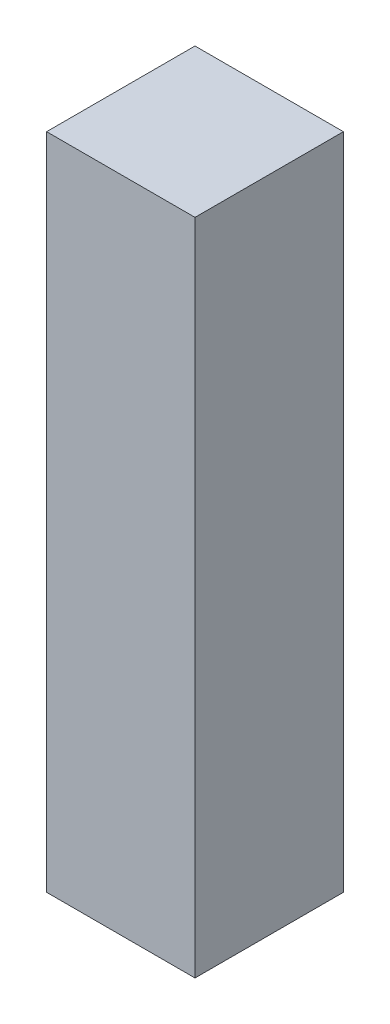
ISO-10303-21;
HEADER;
FILE_DESCRIPTION(('STEP AP214'),'2;1');
FILE_NAME('part.step','',(''),(''),'','','');
FILE_SCHEMA(('AUTOMOTIVE_DESIGN { 1 0 10303 214 1 1 1 1 }'));
ENDSEC;
DATA;
#1=APPLICATION_CONTEXT('core data for automotive mechanical design processes');
#2=APPLICATION_PROTOCOL_DEFINITION('international standard','automotive_design',2000,#1);
#3=PRODUCT_CONTEXT('',#1,'mechanical');
#4=PRODUCT('Part','Part','',(#3));
#5=PRODUCT_RELATED_PRODUCT_CATEGORY('part','',(#4));
#6=PRODUCT_DEFINITION_FORMATION('','',#4);
#7=PRODUCT_DEFINITION_CONTEXT('part definition',#1,'design');
#8=PRODUCT_DEFINITION('design','',#6,#7);
#9=PRODUCT_DEFINITION_SHAPE('','',#8);
#10=(LENGTH_UNIT() NAMED_UNIT(*) SI_UNIT(.MILLI.,.METRE.));
#11=(NAMED_UNIT(*) PLANE_ANGLE_UNIT() SI_UNIT($,.RADIAN.));
#12=(NAMED_UNIT(*) SI_UNIT($,.STERADIAN.) SOLID_ANGLE_UNIT());
#13=UNCERTAINTY_MEASURE_WITH_UNIT(LENGTH_MEASURE(1.E-05),#10,'distance_accuracy_value','');
#14=(GEOMETRIC_REPRESENTATION_CONTEXT(3) GLOBAL_UNCERTAINTY_ASSIGNED_CONTEXT((#13)) GLOBAL_UNIT_ASSIGNED_CONTEXT((#10,
#11,#12)) REPRESENTATION_CONTEXT('',''));
#15=CARTESIAN_POINT('',(0.,0.,0.));
#16=DIRECTION('',(0.,0.,1.));
#17=DIRECTION('',(1.,0.,0.));
#18=AXIS2_PLACEMENT_3D('',#15,#16,#17);
#19=CARTESIAN_POINT('',(-3.26646443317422,29.,-3.26646443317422));
#20=DIRECTION('',(1.,0.,0.));
#21=DIRECTION('',(0.,0.,-1.));
#22=AXIS2_PLACEMENT_3D('',#19,#20,#21);
#23=PLANE('',#22);
#24=DIRECTION('',(0.,0.,1.));
#25=VECTOR('',#24,1.);
#26=CARTESIAN_POINT('',(-3.26646443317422,0.,-3.26646443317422));
#27=LINE('',#26,#25);
#28=CARTESIAN_POINT('',(-3.26646443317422,0.,-3.26646443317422));
#29=VERTEX_POINT('',#28);
#30=CARTESIAN_POINT('',(-3.26646443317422,0.,3.26646443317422));
#31=VERTEX_POINT('',#30);
#32=EDGE_CURVE('E99',#29,#31,#27,.T.);
#33=ORIENTED_EDGE('',*,*,#32,.T.);
#34=DIRECTION('',(0.,-1.,0.));
#35=VECTOR('',#34,1.);
#36=CARTESIAN_POINT('',(-3.26646443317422,29.,3.26646443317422));
#37=LINE('',#36,#35);
#38=CARTESIAN_POINT('',(-3.26646443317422,29.,3.26646443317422));
#39=VERTEX_POINT('',#38);
#40=EDGE_CURVE('E11',#39,#31,#37,.T.);
#41=ORIENTED_EDGE('',*,*,#40,.F.);
#42=DIRECTION('',(0.,0.,1.));
#43=VECTOR('',#42,1.);
#44=CARTESIAN_POINT('',(-3.26646443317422,29.,-3.26646443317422));
#45=LINE('',#44,#43);
#46=CARTESIAN_POINT('',(-3.26646443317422,29.,-3.26646443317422));
#47=VERTEX_POINT('',#46);
#48=EDGE_CURVE('E87',#47,#39,#45,.T.);
#49=ORIENTED_EDGE('',*,*,#48,.F.);
#50=DIRECTION('',(0.,-1.,0.));
#51=VECTOR('',#50,1.);
#52=CARTESIAN_POINT('',(-3.26646443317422,29.,-3.26646443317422));
#53=LINE('',#52,#51);
#54=EDGE_CURVE('E95',#47,#29,#53,.T.);
#55=ORIENTED_EDGE('',*,*,#54,.T.);
#56=EDGE_LOOP('',(#33,#41,#49,#55));
#57=FACE_BOUND('',#56,.T.);
#58=ADVANCED_FACE('F36',(#57),#23,.F.);
#59=CARTESIAN_POINT('',(-3.26646443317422,29.,3.26646443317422));
#60=DIRECTION('',(0.,0.,-1.));
#61=DIRECTION('',(-1.,0.,0.));
#62=AXIS2_PLACEMENT_3D('',#59,#60,#61);
#63=PLANE('',#62);
#64=DIRECTION('',(1.,0.,0.));
#65=VECTOR('',#64,1.);
#66=CARTESIAN_POINT('',(-3.26646443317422,0.,3.26646443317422));
#67=LINE('',#66,#65);
#68=CARTESIAN_POINT('',(3.26646443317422,0.,3.26646443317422));
#69=VERTEX_POINT('',#68);
#70=EDGE_CURVE('E91',#31,#69,#67,.T.);
#71=ORIENTED_EDGE('',*,*,#70,.T.);
#72=DIRECTION('',(0.,-1.,0.));
#73=VECTOR('',#72,1.);
#74=CARTESIAN_POINT('',(3.26646443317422,29.,3.26646443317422));
#75=LINE('',#74,#73);
#76=CARTESIAN_POINT('',(3.26646443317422,29.,3.26646443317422));
#77=VERTEX_POINT('',#76);
#78=EDGE_CURVE('E44',#77,#69,#75,.T.);
#79=ORIENTED_EDGE('',*,*,#78,.F.);
#80=DIRECTION('',(1.,0.,0.));
#81=VECTOR('',#80,1.);
#82=CARTESIAN_POINT('',(-3.26646443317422,29.,3.26646443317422));
#83=LINE('',#82,#81);
#84=EDGE_CURVE('E82',#39,#77,#83,.T.);
#85=ORIENTED_EDGE('',*,*,#84,.F.);
#86=ORIENTED_EDGE('',*,*,#40,.T.);
#87=EDGE_LOOP('',(#71,#79,#85,#86));
#88=FACE_BOUND('',#87,.T.);
#89=ADVANCED_FACE('F90',(#88),#63,.F.);
#90=CARTESIAN_POINT('',(3.26646443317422,29.,-3.26646443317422));
#91=DIRECTION('',(-1.,0.,0.));
#92=DIRECTION('',(0.,0.,1.));
#93=AXIS2_PLACEMENT_3D('',#90,#91,#92);
#94=PLANE('',#93);
#95=DIRECTION('',(0.,0.,-1.));
#96=VECTOR('',#95,1.);
#97=CARTESIAN_POINT('',(3.26646443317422,0.,-3.26646443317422));
#98=LINE('',#97,#96);
#99=CARTESIAN_POINT('',(3.26646443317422,0.,-3.26646443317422));
#100=VERTEX_POINT('',#99);
#101=EDGE_CURVE('E69',#69,#100,#98,.T.);
#102=ORIENTED_EDGE('',*,*,#101,.T.);
#103=DIRECTION('',(0.,-1.,0.));
#104=VECTOR('',#103,1.);
#105=CARTESIAN_POINT('',(3.26646443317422,29.,-3.26646443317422));
#106=LINE('',#105,#104);
#107=CARTESIAN_POINT('',(3.26646443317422,29.,-3.26646443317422));
#108=VERTEX_POINT('',#107);
#109=EDGE_CURVE('E92',#108,#100,#106,.T.);
#110=ORIENTED_EDGE('',*,*,#109,.F.);
#111=DIRECTION('',(0.,0.,-1.));
#112=VECTOR('',#111,1.);
#113=CARTESIAN_POINT('',(3.26646443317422,29.,-3.26646443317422));
#114=LINE('',#113,#112);
#115=EDGE_CURVE('E85',#77,#108,#114,.T.);
#116=ORIENTED_EDGE('',*,*,#115,.F.);
#117=ORIENTED_EDGE('',*,*,#78,.T.);
#118=EDGE_LOOP('',(#102,#110,#116,#117));
#119=FACE_BOUND('',#118,.T.);
#120=ADVANCED_FACE('F93',(#119),#94,.F.);
#121=CARTESIAN_POINT('',(-3.26646443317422,29.,-3.26646443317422));
#122=DIRECTION('',(0.,0.,1.));
#123=DIRECTION('',(1.,0.,0.));
#124=AXIS2_PLACEMENT_3D('',#121,#122,#123);
#125=PLANE('',#124);
#126=DIRECTION('',(-1.,0.,0.));
#127=VECTOR('',#126,1.);
#128=CARTESIAN_POINT('',(-3.26646443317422,0.,-3.26646443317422));
#129=LINE('',#128,#127);
#130=EDGE_CURVE('E75',#100,#29,#129,.T.);
#131=ORIENTED_EDGE('',*,*,#130,.T.);
#132=ORIENTED_EDGE('',*,*,#54,.F.);
#133=DIRECTION('',(-1.,0.,0.));
#134=VECTOR('',#133,1.);
#135=CARTESIAN_POINT('',(-3.26646443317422,29.,-3.26646443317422));
#136=LINE('',#135,#134);
#137=EDGE_CURVE('E52',#108,#47,#136,.T.);
#138=ORIENTED_EDGE('',*,*,#137,.F.);
#139=ORIENTED_EDGE('',*,*,#109,.T.);
#140=EDGE_LOOP('',(#131,#132,#138,#139));
#141=FACE_BOUND('',#140,.T.);
#142=ADVANCED_FACE('F106',(#141),#125,.F.);
#143=CARTESIAN_POINT('',(0.,29.,0.));
#144=DIRECTION('',(0.,1.,0.));
#145=DIRECTION('',(0.,0.,1.));
#146=AXIS2_PLACEMENT_3D('',#143,#144,#145);
#147=PLANE('',#146);
#148=ORIENTED_EDGE('',*,*,#48,.T.);
#149=ORIENTED_EDGE('',*,*,#84,.T.);
#150=ORIENTED_EDGE('',*,*,#115,.T.);
#151=ORIENTED_EDGE('',*,*,#137,.T.);
#152=EDGE_LOOP('',(#148,#149,#150,#151));
#153=FACE_BOUND('',#152,.T.);
#154=ADVANCED_FACE('F83',(#153),#147,.T.);
#155=CARTESIAN_POINT('',(0.,0.,0.));
#156=DIRECTION('',(0.,1.,0.));
#157=DIRECTION('',(0.,0.,1.));
#158=AXIS2_PLACEMENT_3D('',#155,#156,#157);
#159=PLANE('',#158);
#160=ORIENTED_EDGE('',*,*,#32,.F.);
#161=ORIENTED_EDGE('',*,*,#130,.F.);
#162=ORIENTED_EDGE('',*,*,#101,.F.);
#163=ORIENTED_EDGE('',*,*,#70,.F.);
#164=EDGE_LOOP('',(#160,#161,#162,#163));
#165=FACE_BOUND('',#164,.T.);
#166=ADVANCED_FACE('F109',(#165),#159,.F.);
#167=CLOSED_SHELL('',(#58,#89,#120,#142,#154,#166));
#168=MANIFOLD_SOLID_BREP('B2',#167);
#169=ADVANCED_BREP_SHAPE_REPRESENTATION('',(#18,#168),#14);
#170=SHAPE_DEFINITION_REPRESENTATION(#9,#169);
ENDSEC;
END-ISO-10303-21;
